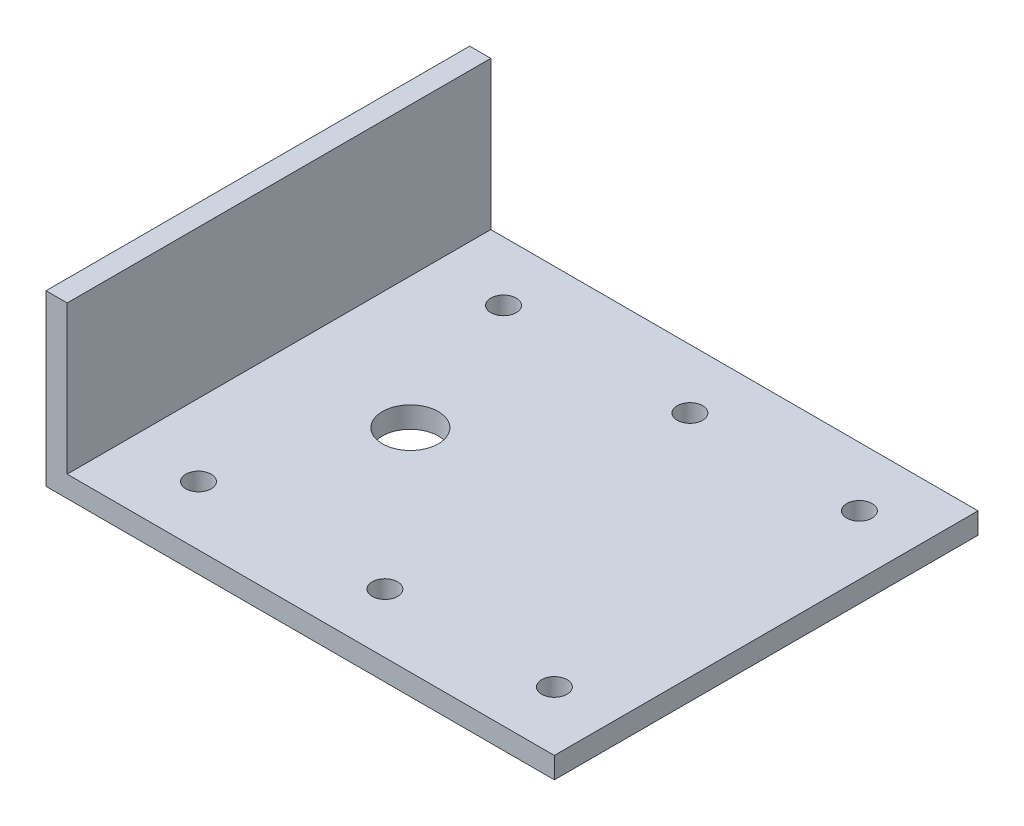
from build123d import *

# Parameters (mm, degrees)
EXTRU_MINCE1_DEPTH = 25
D_GAGEMENT_M61_D   = 6.6
EXTRUSION1_REACH   = 70.007
ESQUISSE6_R        = 1.5


with BuildPart() as part:
    # Esquisse1 → Extru.-Mince1 (new, symmetric)
    with BuildSketch(Plane.XY):
        Polygon((0, 20), (0, 0), (60, 0), (60, 2.5), (2.5, 2.5), (2.5, 20), align=None)
    extrude(amount=EXTRU_MINCE1_DEPTH, both=True)

    # D_gagement M61 (through all)
    with Locations(Plane.XZ):
        with Locations((18, 0)):
            Hole(D_GAGEMENT_M61_D / 2)

    # Esquisse6 → Extrusion1 (cut, up to next)
    with BuildSketch(Plane.XZ, mode=Mode.PRIVATE) as extrusion1_sk1:
        with Locations(Location((53, 18, 0), (0, 0, 270))):
            Circle(ESQUISSE6_R)
    extrusion1_tool1 = extrude(extrusion1_sk1.sketch, amount=-EXTRUSION1_REACH, mode=Mode.PRIVATE) & part.part
    # Esquisse6 → Extrusion1 (cut, up to next)
    with BuildSketch(Plane.XZ, mode=Mode.PRIVATE) as extrusion1_sk2:
        with Locations(Location((53, -18, 0), (0, 0, 270))):
            Circle(ESQUISSE6_R)
    extrusion1_tool2 = extrude(extrusion1_sk2.sketch, amount=-EXTRUSION1_REACH, mode=Mode.PRIVATE) & part.part
    # Esquisse6 → Extrusion1 (cut, up to next)
    with BuildSketch(Plane.XZ, mode=Mode.PRIVATE) as extrusion1_sk3:
        with Locations(Location((33, 18, 0), (0, 0, 270))):
            Circle(ESQUISSE6_R)
    extrusion1_tool3 = extrude(extrusion1_sk3.sketch, amount=-EXTRUSION1_REACH, mode=Mode.PRIVATE) & part.part
    # Esquisse6 → Extrusion1 (cut, up to next)
    with BuildSketch(Plane.XZ, mode=Mode.PRIVATE) as extrusion1_sk4:
        with Locations(Location((33, -18, 0), (0, 0, 270))):
            Circle(ESQUISSE6_R)
    extrusion1_tool4 = extrude(extrusion1_sk4.sketch, amount=-EXTRUSION1_REACH, mode=Mode.PRIVATE) & part.part
    # Esquisse6 → Extrusion1 (cut, up to next)
    with BuildSketch(Plane.XZ, mode=Mode.PRIVATE) as extrusion1_sk5:
        with Locations(Location((11, 18, 0), (0, 0, 270))):
            Circle(ESQUISSE6_R)
    extrusion1_tool5 = extrude(extrusion1_sk5.sketch, amount=-EXTRUSION1_REACH, mode=Mode.PRIVATE) & part.part
    # Esquisse6 → Extrusion1 (cut, up to next)
    with BuildSketch(Plane.XZ, mode=Mode.PRIVATE) as extrusion1_sk6:
        with Locations(Location((11, -18, 0), (0, 0, 270))):
            Circle(ESQUISSE6_R)
    extrusion1_tool6 = extrude(extrusion1_sk6.sketch, amount=-EXTRUSION1_REACH, mode=Mode.PRIVATE) & part.part
    add(extrusion1_tool1.solids().sort_by_distance((53, 0, 18))[0], mode=Mode.SUBTRACT)
    add(extrusion1_tool2.solids().sort_by_distance((53, 0, -18))[0], mode=Mode.SUBTRACT)
    add(extrusion1_tool3.solids().sort_by_distance((33, 0, 18))[0], mode=Mode.SUBTRACT)
    add(extrusion1_tool4.solids().sort_by_distance((33, 0, -18))[0], mode=Mode.SUBTRACT)
    add(extrusion1_tool5.solids().sort_by_distance((11, 0, 18))[0], mode=Mode.SUBTRACT)
    add(extrusion1_tool6.solids().sort_by_distance((11, 0, -18))[0], mode=Mode.SUBTRACT)


solid = part.part
